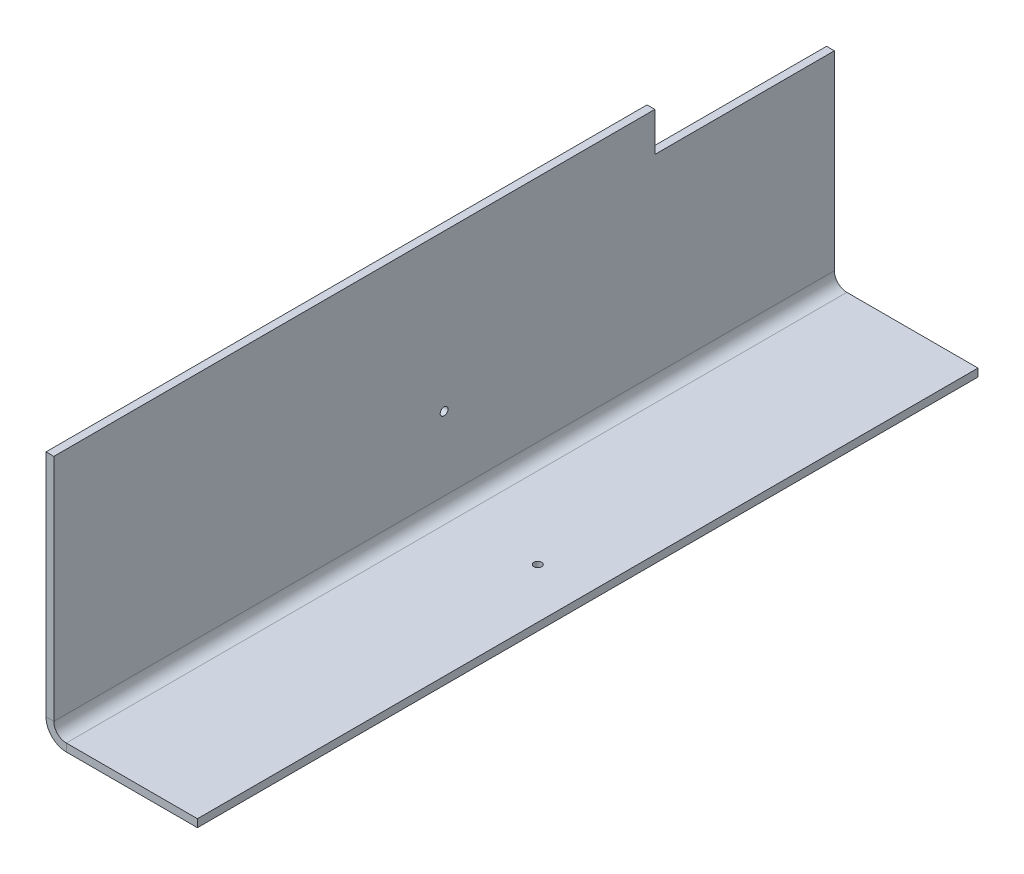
ISO-10303-21;
HEADER;
FILE_DESCRIPTION(('STEP AP214'),'2;1');
FILE_NAME('part.step','',(''),(''),'','','');
FILE_SCHEMA(('AUTOMOTIVE_DESIGN { 1 0 10303 214 1 1 1 1 }'));
ENDSEC;
DATA;
#1=APPLICATION_CONTEXT('core data for automotive mechanical design processes');
#2=APPLICATION_PROTOCOL_DEFINITION('international standard','automotive_design',2000,#1);
#3=PRODUCT_CONTEXT('',#1,'mechanical');
#4=PRODUCT('Part','Part','',(#3));
#5=PRODUCT_RELATED_PRODUCT_CATEGORY('part','',(#4));
#6=PRODUCT_DEFINITION_FORMATION('','',#4);
#7=PRODUCT_DEFINITION_CONTEXT('part definition',#1,'design');
#8=PRODUCT_DEFINITION('design','',#6,#7);
#9=PRODUCT_DEFINITION_SHAPE('','',#8);
#10=(LENGTH_UNIT() NAMED_UNIT(*) SI_UNIT(.MILLI.,.METRE.));
#11=(NAMED_UNIT(*) PLANE_ANGLE_UNIT() SI_UNIT($,.RADIAN.));
#12=(NAMED_UNIT(*) SI_UNIT($,.STERADIAN.) SOLID_ANGLE_UNIT());
#13=UNCERTAINTY_MEASURE_WITH_UNIT(LENGTH_MEASURE(1.E-05),#10,'distance_accuracy_value','');
#14=(GEOMETRIC_REPRESENTATION_CONTEXT(3) GLOBAL_UNCERTAINTY_ASSIGNED_CONTEXT((#13)) GLOBAL_UNIT_ASSIGNED_CONTEXT((#10,
#11,#12)) REPRESENTATION_CONTEXT('',''));
#15=CARTESIAN_POINT('',(0.,0.,0.));
#16=DIRECTION('',(0.,0.,1.));
#17=DIRECTION('',(1.,0.,0.));
#18=AXIS2_PLACEMENT_3D('',#15,#16,#17);
#19=CARTESIAN_POINT('',(13.,-160.,-500.));
#20=DIRECTION('',(0.,0.,-1.));
#21=DIRECTION('',(-1.,0.,0.));
#22=AXIS2_PLACEMENT_3D('',#19,#20,#21);
#23=PLANE('',#22);
#24=DIRECTION('',(0.,1.,0.));
#25=VECTOR('',#24,1.);
#26=CARTESIAN_POINT('',(13.,-160.,-500.));
#27=LINE('',#26,#25);
#28=CARTESIAN_POINT('',(13.,-160.,-500.));
#29=VERTEX_POINT('',#28);
#30=CARTESIAN_POINT('',(13.,-155.,-500.));
#31=VERTEX_POINT('',#30);
#32=EDGE_CURVE('E56',#29,#31,#27,.T.);
#33=ORIENTED_EDGE('',*,*,#32,.F.);
#34=CARTESIAN_POINT('',(13.,-147.,-500.));
#35=DIRECTION('',(0.,0.,-1.));
#36=DIRECTION('',(-1.,0.,0.));
#37=AXIS2_PLACEMENT_3D('',#34,#35,#36);
#38=CIRCLE('',#37,13.);
#39=CARTESIAN_POINT('',(0.,-147.,-500.));
#40=VERTEX_POINT('',#39);
#41=EDGE_CURVE('E154',#40,#29,#38,.F.);
#42=ORIENTED_EDGE('',*,*,#41,.F.);
#43=DIRECTION('',(-1.,0.,0.));
#44=VECTOR('',#43,1.);
#45=CARTESIAN_POINT('',(5.00000000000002,-147.,-500.));
#46=LINE('',#45,#44);
#47=CARTESIAN_POINT('',(5.00000000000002,-147.,-500.));
#48=VERTEX_POINT('',#47);
#49=EDGE_CURVE('E159',#48,#40,#46,.T.);
#50=ORIENTED_EDGE('',*,*,#49,.F.);
#51=CARTESIAN_POINT('',(13.,-147.,-500.));
#52=DIRECTION('',(0.,0.,1.));
#53=DIRECTION('',(1.,0.,0.));
#54=AXIS2_PLACEMENT_3D('',#51,#52,#53);
#55=CIRCLE('',#54,8.);
#56=EDGE_CURVE('E180',#48,#31,#55,.T.);
#57=ORIENTED_EDGE('',*,*,#56,.T.);
#58=EDGE_LOOP('',(#33,#42,#50,#57));
#59=FACE_BOUND('',#58,.T.);
#60=ADVANCED_FACE('F33',(#59),#23,.T.);
#61=CARTESIAN_POINT('',(5.00000000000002,-147.,-500.));
#62=DIRECTION('',(0.,0.,-1.));
#63=DIRECTION('',(-1.,0.,0.));
#64=AXIS2_PLACEMENT_3D('',#61,#62,#63);
#65=PLANE('',#64);
#66=DIRECTION('',(1.,0.,0.));
#67=VECTOR('',#66,1.);
#68=CARTESIAN_POINT('',(0.,-160.,-500.));
#69=LINE('',#68,#67);
#70=CARTESIAN_POINT('',(97.,-160.,-500.));
#71=VERTEX_POINT('',#70);
#72=EDGE_CURVE('E211',#29,#71,#69,.T.);
#73=ORIENTED_EDGE('',*,*,#72,.F.);
#74=ORIENTED_EDGE('',*,*,#32,.T.);
#75=DIRECTION('',(1.,0.,0.));
#76=VECTOR('',#75,1.);
#77=CARTESIAN_POINT('',(0.,-155.,-500.));
#78=LINE('',#77,#76);
#79=CARTESIAN_POINT('',(97.,-155.,-500.));
#80=VERTEX_POINT('',#79);
#81=EDGE_CURVE('E183',#31,#80,#78,.T.);
#82=ORIENTED_EDGE('',*,*,#81,.T.);
#83=DIRECTION('',(0.,-1.,0.));
#84=VECTOR('',#83,1.);
#85=CARTESIAN_POINT('',(97.,-155.,-500.));
#86=LINE('',#85,#84);
#87=EDGE_CURVE('E213',#80,#71,#86,.T.);
#88=ORIENTED_EDGE('',*,*,#87,.T.);
#89=EDGE_LOOP('',(#73,#74,#82,#88));
#90=FACE_BOUND('',#89,.T.);
#91=ADVANCED_FACE('F222',(#90),#65,.T.);
#92=CARTESIAN_POINT('',(0.,-147.,0.));
#93=DIRECTION('',(0.,0.,1.));
#94=DIRECTION('',(1.,0.,0.));
#95=AXIS2_PLACEMENT_3D('',#92,#93,#94);
#96=PLANE('',#95);
#97=DIRECTION('',(1.,0.,0.));
#98=VECTOR('',#97,1.);
#99=CARTESIAN_POINT('',(0.,-147.,0.));
#100=LINE('',#99,#98);
#101=CARTESIAN_POINT('',(0.,-147.,0.));
#102=VERTEX_POINT('',#101);
#103=CARTESIAN_POINT('',(5.00000000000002,-147.,0.));
#104=VERTEX_POINT('',#103);
#105=EDGE_CURVE('E157',#102,#104,#100,.T.);
#106=ORIENTED_EDGE('',*,*,#105,.F.);
#107=CARTESIAN_POINT('',(13.,-147.,0.));
#108=DIRECTION('',(0.,0.,-1.));
#109=DIRECTION('',(-1.,0.,0.));
#110=AXIS2_PLACEMENT_3D('',#107,#108,#109);
#111=CIRCLE('',#110,13.);
#112=CARTESIAN_POINT('',(13.,-160.,0.));
#113=VERTEX_POINT('',#112);
#114=EDGE_CURVE('E195',#102,#113,#111,.F.);
#115=ORIENTED_EDGE('',*,*,#114,.T.);
#116=DIRECTION('',(0.,-1.,0.));
#117=VECTOR('',#116,1.);
#118=CARTESIAN_POINT('',(13.,-155.,0.));
#119=LINE('',#118,#117);
#120=CARTESIAN_POINT('',(13.,-155.,0.));
#121=VERTEX_POINT('',#120);
#122=EDGE_CURVE('E155',#121,#113,#119,.T.);
#123=ORIENTED_EDGE('',*,*,#122,.F.);
#124=CARTESIAN_POINT('',(13.,-147.,0.));
#125=DIRECTION('',(0.,0.,1.));
#126=DIRECTION('',(1.,0.,0.));
#127=AXIS2_PLACEMENT_3D('',#124,#125,#126);
#128=CIRCLE('',#127,8.);
#129=EDGE_CURVE('E231',#104,#121,#128,.T.);
#130=ORIENTED_EDGE('',*,*,#129,.F.);
#131=EDGE_LOOP('',(#106,#115,#123,#130));
#132=FACE_BOUND('',#131,.T.);
#133=ADVANCED_FACE('F208',(#132),#96,.T.);
#134=CARTESIAN_POINT('',(13.,-155.,0.));
#135=DIRECTION('',(0.,0.,1.));
#136=DIRECTION('',(1.,0.,0.));
#137=AXIS2_PLACEMENT_3D('',#134,#135,#136);
#138=PLANE('',#137);
#139=DIRECTION('',(0.,-1.,0.));
#140=VECTOR('',#139,1.);
#141=CARTESIAN_POINT('',(0.,0.,0.));
#142=LINE('',#141,#140);
#143=CARTESIAN_POINT('',(0.,0.,0.));
#144=VERTEX_POINT('',#143);
#145=EDGE_CURVE('E135',#144,#102,#142,.T.);
#146=ORIENTED_EDGE('',*,*,#145,.T.);
#147=ORIENTED_EDGE('',*,*,#105,.T.);
#148=DIRECTION('',(0.,-1.,0.));
#149=VECTOR('',#148,1.);
#150=CARTESIAN_POINT('',(5.,0.,0.));
#151=LINE('',#150,#149);
#152=CARTESIAN_POINT('',(5.,0.,0.));
#153=VERTEX_POINT('',#152);
#154=EDGE_CURVE('E236',#153,#104,#151,.T.);
#155=ORIENTED_EDGE('',*,*,#154,.F.);
#156=DIRECTION('',(1.,0.,0.));
#157=VECTOR('',#156,1.);
#158=CARTESIAN_POINT('',(0.,0.,0.));
#159=LINE('',#158,#157);
#160=EDGE_CURVE('E215',#144,#153,#159,.T.);
#161=ORIENTED_EDGE('',*,*,#160,.F.);
#162=EDGE_LOOP('',(#146,#147,#155,#161));
#163=FACE_BOUND('',#162,.T.);
#164=ADVANCED_FACE('F239',(#163),#138,.T.);
#165=CARTESIAN_POINT('',(0.,-160.,-500.));
#166=DIRECTION('',(0.,-1.,0.));
#167=DIRECTION('',(0.,0.,-1.));
#168=AXIS2_PLACEMENT_3D('',#165,#166,#167);
#169=PLANE('',#168);
#170=CARTESIAN_POINT('',(65.,-160.,-250.));
#171=DIRECTION('',(0.,-1.,0.));
#172=DIRECTION('',(0.,0.,-1.));
#173=AXIS2_PLACEMENT_3D('',#170,#171,#172);
#174=CIRCLE('',#173,2.50000000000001);
#175=CARTESIAN_POINT('',(65.,-160.,-252.5));
#176=VERTEX_POINT('',#175);
#177=EDGE_CURVE('E433',#176,#176,#174,.T.);
#178=ORIENTED_EDGE('',*,*,#177,.F.);
#179=EDGE_LOOP('',(#178));
#180=FACE_BOUND('',#179,.T.);
#181=DIRECTION('',(1.,0.,0.));
#182=VECTOR('',#181,1.);
#183=CARTESIAN_POINT('',(0.,-160.,0.));
#184=LINE('',#183,#182);
#185=CARTESIAN_POINT('',(97.,-160.,0.));
#186=VERTEX_POINT('',#185);
#187=EDGE_CURVE('E166',#113,#186,#184,.T.);
#188=ORIENTED_EDGE('',*,*,#187,.F.);
#189=DIRECTION('',(0.,0.,1.));
#190=VECTOR('',#189,1.);
#191=CARTESIAN_POINT('',(13.,-160.,-500.));
#192=LINE('',#191,#190);
#193=EDGE_CURVE('E138',#29,#113,#192,.T.);
#194=ORIENTED_EDGE('',*,*,#193,.F.);
#195=ORIENTED_EDGE('',*,*,#72,.T.);
#196=DIRECTION('',(0.,0.,1.));
#197=VECTOR('',#196,1.);
#198=CARTESIAN_POINT('',(97.,-160.,-500.));
#199=LINE('',#198,#197);
#200=EDGE_CURVE('E152',#71,#186,#199,.T.);
#201=ORIENTED_EDGE('',*,*,#200,.T.);
#202=EDGE_LOOP('',(#188,#194,#195,#201));
#203=FACE_BOUND('',#202,.T.);
#204=ADVANCED_FACE('F200',(#180,#203),#169,.T.);
#205=CARTESIAN_POINT('',(13.,-147.,-500.));
#206=DIRECTION('',(0.,0.,1.));
#207=DIRECTION('',(1.,0.,0.));
#208=AXIS2_PLACEMENT_3D('',#205,#206,#207);
#209=CYLINDRICAL_SURFACE('',#208,13.);
#210=ORIENTED_EDGE('',*,*,#114,.F.);
#211=DIRECTION('',(0.,0.,1.));
#212=VECTOR('',#211,1.);
#213=CARTESIAN_POINT('',(0.,-147.,-500.));
#214=LINE('',#213,#212);
#215=EDGE_CURVE('E136',#40,#102,#214,.T.);
#216=ORIENTED_EDGE('',*,*,#215,.F.);
#217=ORIENTED_EDGE('',*,*,#41,.T.);
#218=ORIENTED_EDGE('',*,*,#193,.T.);
#219=EDGE_LOOP('',(#210,#216,#217,#218));
#220=FACE_BOUND('',#219,.T.);
#221=ADVANCED_FACE('F192',(#220),#209,.T.);
#222=CARTESIAN_POINT('',(0.,0.,-500.));
#223=DIRECTION('',(-1.,0.,0.));
#224=DIRECTION('',(0.,-1.,0.));
#225=AXIS2_PLACEMENT_3D('',#222,#223,#224);
#226=PLANE('',#225);
#227=DIRECTION('',(0.,1.,0.));
#228=VECTOR('',#227,1.);
#229=CARTESIAN_POINT('',(0.,0.,-385.));
#230=LINE('',#229,#228);
#231=CARTESIAN_POINT('',(0.,-25.,-385.));
#232=VERTEX_POINT('',#231);
#233=CARTESIAN_POINT('',(0.,0.,-385.));
#234=VERTEX_POINT('',#233);
#235=EDGE_CURVE('E111',#232,#234,#230,.T.);
#236=ORIENTED_EDGE('',*,*,#235,.F.);
#237=DIRECTION('',(0.,0.,1.));
#238=VECTOR('',#237,1.);
#239=CARTESIAN_POINT('',(0.,-25.,-385.));
#240=LINE('',#239,#238);
#241=CARTESIAN_POINT('',(0.,-25.,-500.));
#242=VERTEX_POINT('',#241);
#243=EDGE_CURVE('E120',#242,#232,#240,.T.);
#244=ORIENTED_EDGE('',*,*,#243,.F.);
#245=DIRECTION('',(0.,-1.,0.));
#246=VECTOR('',#245,1.);
#247=CARTESIAN_POINT('',(0.,0.,-500.));
#248=LINE('',#247,#246);
#249=EDGE_CURVE('E174',#242,#40,#248,.T.);
#250=ORIENTED_EDGE('',*,*,#249,.T.);
#251=ORIENTED_EDGE('',*,*,#215,.T.);
#252=ORIENTED_EDGE('',*,*,#145,.F.);
#253=DIRECTION('',(0.,0.,1.));
#254=VECTOR('',#253,1.);
#255=CARTESIAN_POINT('',(0.,0.,-500.));
#256=LINE('',#255,#254);
#257=EDGE_CURVE('E126',#234,#144,#256,.T.);
#258=ORIENTED_EDGE('',*,*,#257,.F.);
#259=EDGE_LOOP('',(#236,#244,#250,#251,#252,#258));
#260=FACE_BOUND('',#259,.T.);
#261=CARTESIAN_POINT('',(0.,-100.,-250.));
#262=DIRECTION('',(-1.,0.,0.));
#263=DIRECTION('',(0.,-1.,0.));
#264=AXIS2_PLACEMENT_3D('',#261,#262,#263);
#265=CIRCLE('',#264,2.5);
#266=CARTESIAN_POINT('',(0.,-102.5,-250.));
#267=VERTEX_POINT('',#266);
#268=EDGE_CURVE('E167',#267,#267,#265,.T.);
#269=ORIENTED_EDGE('',*,*,#268,.F.);
#270=EDGE_LOOP('',(#269));
#271=FACE_BOUND('',#270,.T.);
#272=ADVANCED_FACE('F131',(#260,#271),#226,.T.);
#273=CARTESIAN_POINT('',(0.,0.,-500.));
#274=DIRECTION('',(0.,-1.,0.));
#275=DIRECTION('',(1.,0.,0.));
#276=AXIS2_PLACEMENT_3D('',#273,#274,#275);
#277=PLANE('',#276);
#278=DIRECTION('',(0.,0.,1.));
#279=VECTOR('',#278,1.);
#280=CARTESIAN_POINT('',(5.,0.,-500.));
#281=LINE('',#280,#279);
#282=CARTESIAN_POINT('',(5.,0.,-385.));
#283=VERTEX_POINT('',#282);
#284=EDGE_CURVE('E128',#283,#153,#281,.T.);
#285=ORIENTED_EDGE('',*,*,#284,.F.);
#286=DIRECTION('',(-1.,0.,0.));
#287=VECTOR('',#286,1.);
#288=CARTESIAN_POINT('',(97.,0.,-385.));
#289=LINE('',#288,#287);
#290=EDGE_CURVE('E114',#283,#234,#289,.T.);
#291=ORIENTED_EDGE('',*,*,#290,.T.);
#292=ORIENTED_EDGE('',*,*,#257,.T.);
#293=ORIENTED_EDGE('',*,*,#160,.T.);
#294=EDGE_LOOP('',(#285,#291,#292,#293));
#295=FACE_BOUND('',#294,.T.);
#296=ADVANCED_FACE('F124',(#295),#277,.F.);
#297=CARTESIAN_POINT('',(5.,0.,-500.));
#298=DIRECTION('',(-1.,0.,0.));
#299=DIRECTION('',(0.,-1.,0.));
#300=AXIS2_PLACEMENT_3D('',#297,#298,#299);
#301=PLANE('',#300);
#302=CARTESIAN_POINT('',(5.00000000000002,-100.,-250.));
#303=DIRECTION('',(-1.,0.,0.));
#304=DIRECTION('',(0.,-1.,0.));
#305=AXIS2_PLACEMENT_3D('',#302,#303,#304);
#306=CIRCLE('',#305,2.5);
#307=CARTESIAN_POINT('',(5.00000000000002,-102.5,-250.));
#308=VERTEX_POINT('',#307);
#309=EDGE_CURVE('E163',#308,#308,#306,.T.);
#310=ORIENTED_EDGE('',*,*,#309,.T.);
#311=EDGE_LOOP('',(#310));
#312=FACE_BOUND('',#311,.T.);
#313=DIRECTION('',(0.,0.,1.));
#314=VECTOR('',#313,1.);
#315=CARTESIAN_POINT('',(5.,-25.,-500.));
#316=LINE('',#315,#314);
#317=CARTESIAN_POINT('',(5.,-25.,-500.));
#318=VERTEX_POINT('',#317);
#319=CARTESIAN_POINT('',(5.,-25.,-385.));
#320=VERTEX_POINT('',#319);
#321=EDGE_CURVE('E48',#318,#320,#316,.T.);
#322=ORIENTED_EDGE('',*,*,#321,.T.);
#323=DIRECTION('',(0.,1.,0.));
#324=VECTOR('',#323,1.);
#325=CARTESIAN_POINT('',(5.,0.,-385.));
#326=LINE('',#325,#324);
#327=EDGE_CURVE('E11',#320,#283,#326,.T.);
#328=ORIENTED_EDGE('',*,*,#327,.T.);
#329=ORIENTED_EDGE('',*,*,#284,.T.);
#330=ORIENTED_EDGE('',*,*,#154,.T.);
#331=DIRECTION('',(0.,0.,1.));
#332=VECTOR('',#331,1.);
#333=CARTESIAN_POINT('',(5.00000000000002,-147.,-500.));
#334=LINE('',#333,#332);
#335=EDGE_CURVE('E140',#48,#104,#334,.T.);
#336=ORIENTED_EDGE('',*,*,#335,.F.);
#337=DIRECTION('',(0.,-1.,0.));
#338=VECTOR('',#337,1.);
#339=CARTESIAN_POINT('',(5.,0.,-500.));
#340=LINE('',#339,#338);
#341=EDGE_CURVE('E172',#318,#48,#340,.T.);
#342=ORIENTED_EDGE('',*,*,#341,.F.);
#343=EDGE_LOOP('',(#322,#328,#329,#330,#336,#342));
#344=FACE_BOUND('',#343,.T.);
#345=ADVANCED_FACE('F177',(#312,#344),#301,.F.);
#346=CARTESIAN_POINT('',(13.,-147.,-500.));
#347=DIRECTION('',(0.,0.,1.));
#348=DIRECTION('',(1.,0.,0.));
#349=AXIS2_PLACEMENT_3D('',#346,#347,#348);
#350=CYLINDRICAL_SURFACE('',#349,8.);
#351=ORIENTED_EDGE('',*,*,#129,.T.);
#352=DIRECTION('',(0.,0.,1.));
#353=VECTOR('',#352,1.);
#354=CARTESIAN_POINT('',(13.,-155.,-500.));
#355=LINE('',#354,#353);
#356=EDGE_CURVE('E146',#31,#121,#355,.T.);
#357=ORIENTED_EDGE('',*,*,#356,.F.);
#358=ORIENTED_EDGE('',*,*,#56,.F.);
#359=ORIENTED_EDGE('',*,*,#335,.T.);
#360=EDGE_LOOP('',(#351,#357,#358,#359));
#361=FACE_BOUND('',#360,.T.);
#362=ADVANCED_FACE('F241',(#361),#350,.F.);
#363=CARTESIAN_POINT('',(0.,-155.,-500.));
#364=DIRECTION('',(0.,-1.,0.));
#365=DIRECTION('',(0.,0.,-1.));
#366=AXIS2_PLACEMENT_3D('',#363,#364,#365);
#367=PLANE('',#366);
#368=CARTESIAN_POINT('',(65.,-155.,-250.));
#369=DIRECTION('',(0.,-1.,0.));
#370=DIRECTION('',(0.,0.,-1.));
#371=AXIS2_PLACEMENT_3D('',#368,#369,#370);
#372=CIRCLE('',#371,2.50000000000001);
#373=CARTESIAN_POINT('',(65.,-155.,-252.5));
#374=VERTEX_POINT('',#373);
#375=EDGE_CURVE('E36',#374,#374,#372,.T.);
#376=ORIENTED_EDGE('',*,*,#375,.T.);
#377=EDGE_LOOP('',(#376));
#378=FACE_BOUND('',#377,.T.);
#379=DIRECTION('',(1.,0.,0.));
#380=VECTOR('',#379,1.);
#381=CARTESIAN_POINT('',(0.,-155.,0.));
#382=LINE('',#381,#380);
#383=CARTESIAN_POINT('',(97.,-155.,0.));
#384=VERTEX_POINT('',#383);
#385=EDGE_CURVE('E227',#121,#384,#382,.T.);
#386=ORIENTED_EDGE('',*,*,#385,.T.);
#387=DIRECTION('',(0.,0.,1.));
#388=VECTOR('',#387,1.);
#389=CARTESIAN_POINT('',(97.,-155.,-500.));
#390=LINE('',#389,#388);
#391=EDGE_CURVE('E149',#80,#384,#390,.T.);
#392=ORIENTED_EDGE('',*,*,#391,.F.);
#393=ORIENTED_EDGE('',*,*,#81,.F.);
#394=ORIENTED_EDGE('',*,*,#356,.T.);
#395=EDGE_LOOP('',(#386,#392,#393,#394));
#396=FACE_BOUND('',#395,.T.);
#397=ADVANCED_FACE('F225',(#378,#396),#367,.F.);
#398=CARTESIAN_POINT('',(97.,-155.,-500.));
#399=DIRECTION('',(-1.,0.,0.));
#400=DIRECTION('',(0.,0.,1.));
#401=AXIS2_PLACEMENT_3D('',#398,#399,#400);
#402=PLANE('',#401);
#403=DIRECTION('',(0.,-1.,0.));
#404=VECTOR('',#403,1.);
#405=CARTESIAN_POINT('',(97.,-155.,0.));
#406=LINE('',#405,#404);
#407=EDGE_CURVE('E205',#384,#186,#406,.T.);
#408=ORIENTED_EDGE('',*,*,#407,.T.);
#409=ORIENTED_EDGE('',*,*,#200,.F.);
#410=ORIENTED_EDGE('',*,*,#87,.F.);
#411=ORIENTED_EDGE('',*,*,#391,.T.);
#412=EDGE_LOOP('',(#408,#409,#410,#411));
#413=FACE_BOUND('',#412,.T.);
#414=ADVANCED_FACE('F229',(#413),#402,.F.);
#415=CARTESIAN_POINT('',(13.,-147.,-500.));
#416=DIRECTION('',(0.,0.,1.));
#417=DIRECTION('',(1.,0.,0.));
#418=AXIS2_PLACEMENT_3D('',#415,#416,#417);
#419=PLANE('',#418);
#420=ORIENTED_EDGE('',*,*,#249,.F.);
#421=DIRECTION('',(1.,0.,0.));
#422=VECTOR('',#421,1.);
#423=CARTESIAN_POINT('',(13.,-25.,-500.));
#424=LINE('',#423,#422);
#425=EDGE_CURVE('E41',#242,#318,#424,.T.);
#426=ORIENTED_EDGE('',*,*,#425,.T.);
#427=ORIENTED_EDGE('',*,*,#341,.T.);
#428=ORIENTED_EDGE('',*,*,#49,.T.);
#429=EDGE_LOOP('',(#420,#426,#427,#428));
#430=FACE_BOUND('',#429,.T.);
#431=ADVANCED_FACE('F171',(#430),#419,.F.);
#432=CARTESIAN_POINT('',(13.,-147.,0.));
#433=DIRECTION('',(0.,0.,1.));
#434=DIRECTION('',(1.,0.,0.));
#435=AXIS2_PLACEMENT_3D('',#432,#433,#434);
#436=PLANE('',#435);
#437=ORIENTED_EDGE('',*,*,#187,.T.);
#438=ORIENTED_EDGE('',*,*,#407,.F.);
#439=ORIENTED_EDGE('',*,*,#385,.F.);
#440=ORIENTED_EDGE('',*,*,#122,.T.);
#441=EDGE_LOOP('',(#437,#438,#439,#440));
#442=FACE_BOUND('',#441,.T.);
#443=ADVANCED_FACE('F287',(#442),#436,.T.);
#444=CARTESIAN_POINT('',(97.,-100.,-250.));
#445=DIRECTION('',(-1.,0.,0.));
#446=DIRECTION('',(0.,-1.,0.));
#447=AXIS2_PLACEMENT_3D('',#444,#445,#446);
#448=CYLINDRICAL_SURFACE('',#447,2.5);
#449=ORIENTED_EDGE('',*,*,#268,.T.);
#450=EDGE_LOOP('',(#449));
#451=FACE_BOUND('',#450,.T.);
#452=ORIENTED_EDGE('',*,*,#309,.F.);
#453=EDGE_LOOP('',(#452));
#454=FACE_BOUND('',#453,.T.);
#455=ADVANCED_FACE('F250',(#451,#454),#448,.F.);
#456=CARTESIAN_POINT('',(97.,0.,-385.));
#457=DIRECTION('',(0.,0.,1.));
#458=DIRECTION('',(1.,0.,0.));
#459=AXIS2_PLACEMENT_3D('',#456,#457,#458);
#460=PLANE('',#459);
#461=DIRECTION('',(-1.,0.,0.));
#462=VECTOR('',#461,1.);
#463=CARTESIAN_POINT('',(97.,-25.,-385.));
#464=LINE('',#463,#462);
#465=EDGE_CURVE('E115',#320,#232,#464,.T.);
#466=ORIENTED_EDGE('',*,*,#465,.T.);
#467=ORIENTED_EDGE('',*,*,#235,.T.);
#468=ORIENTED_EDGE('',*,*,#290,.F.);
#469=ORIENTED_EDGE('',*,*,#327,.F.);
#470=EDGE_LOOP('',(#466,#467,#468,#469));
#471=FACE_BOUND('',#470,.T.);
#472=ADVANCED_FACE('F113',(#471),#460,.F.);
#473=CARTESIAN_POINT('',(97.,-25.,-385.));
#474=DIRECTION('',(0.,-1.,0.));
#475=DIRECTION('',(1.,0.,0.));
#476=AXIS2_PLACEMENT_3D('',#473,#474,#475);
#477=PLANE('',#476);
#478=ORIENTED_EDGE('',*,*,#425,.F.);
#479=ORIENTED_EDGE('',*,*,#243,.T.);
#480=ORIENTED_EDGE('',*,*,#465,.F.);
#481=ORIENTED_EDGE('',*,*,#321,.F.);
#482=EDGE_LOOP('',(#478,#479,#480,#481));
#483=FACE_BOUND('',#482,.T.);
#484=ADVANCED_FACE('F293',(#483),#477,.F.);
#485=CARTESIAN_POINT('',(65.,0.,-250.));
#486=DIRECTION('',(0.,-1.,0.));
#487=DIRECTION('',(0.,0.,-1.));
#488=AXIS2_PLACEMENT_3D('',#485,#486,#487);
#489=CYLINDRICAL_SURFACE('',#488,2.50000000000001);
#490=ORIENTED_EDGE('',*,*,#177,.T.);
#491=EDGE_LOOP('',(#490));
#492=FACE_BOUND('',#491,.T.);
#493=ORIENTED_EDGE('',*,*,#375,.F.);
#494=EDGE_LOOP('',(#493));
#495=FACE_BOUND('',#494,.T.);
#496=ADVANCED_FACE('F413',(#492,#495),#489,.F.);
#497=CLOSED_SHELL('',(#60,#91,#133,#164,#204,#221,#272,#296,#345,#362,#397,#414,#431,#443,#455,
#472,#484,#496));
#498=MANIFOLD_SOLID_BREP('B2',#497);
#499=ADVANCED_BREP_SHAPE_REPRESENTATION('',(#18,#498),#14);
#500=SHAPE_DEFINITION_REPRESENTATION(#9,#499);
ENDSEC;
END-ISO-10303-21;
